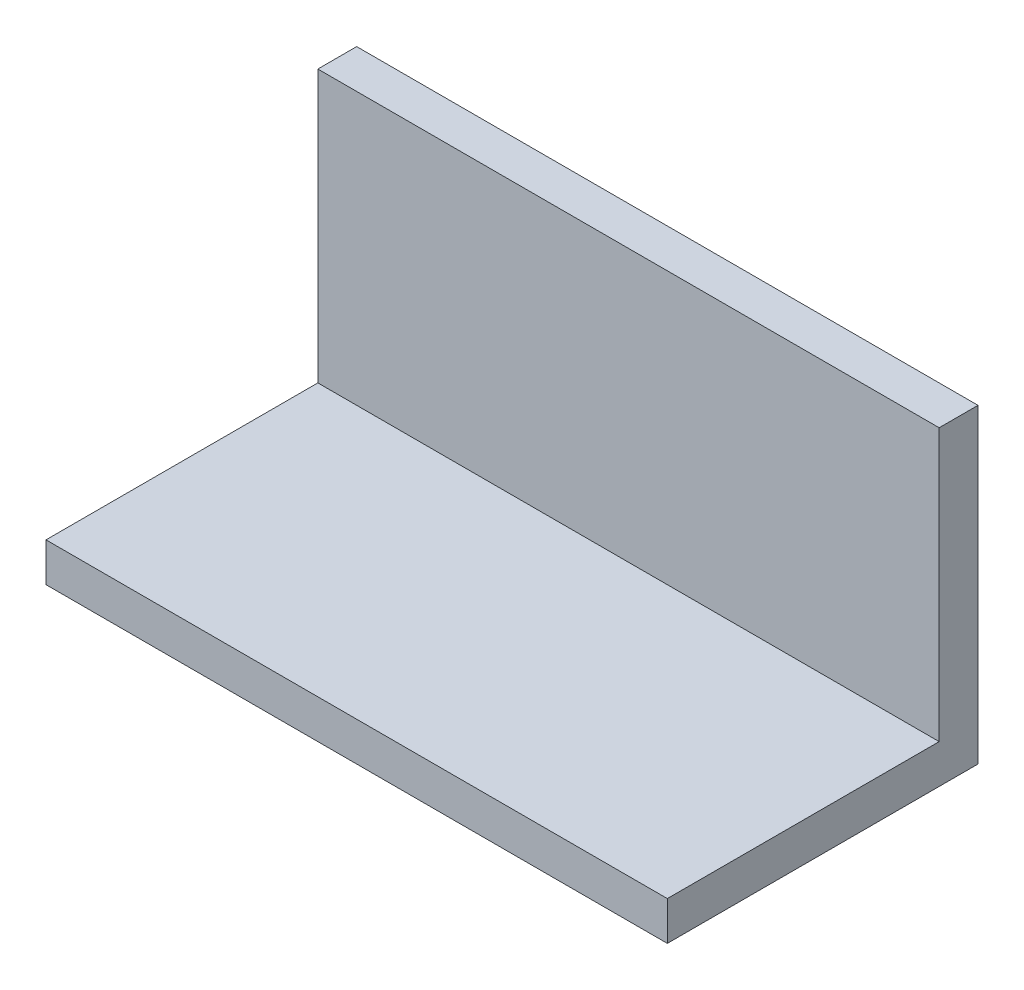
ISO-10303-21;
HEADER;
FILE_DESCRIPTION(('STEP AP214'),'2;1');
FILE_NAME('part.step','',(''),(''),'','','');
FILE_SCHEMA(('AUTOMOTIVE_DESIGN { 1 0 10303 214 1 1 1 1 }'));
ENDSEC;
DATA;
#1=APPLICATION_CONTEXT('core data for automotive mechanical design processes');
#2=APPLICATION_PROTOCOL_DEFINITION('international standard','automotive_design',2000,#1);
#3=PRODUCT_CONTEXT('',#1,'mechanical');
#4=PRODUCT('Part','Part','',(#3));
#5=PRODUCT_RELATED_PRODUCT_CATEGORY('part','',(#4));
#6=PRODUCT_DEFINITION_FORMATION('','',#4);
#7=PRODUCT_DEFINITION_CONTEXT('part definition',#1,'design');
#8=PRODUCT_DEFINITION('design','',#6,#7);
#9=PRODUCT_DEFINITION_SHAPE('','',#8);
#10=(LENGTH_UNIT() NAMED_UNIT(*) SI_UNIT(.MILLI.,.METRE.));
#11=(NAMED_UNIT(*) PLANE_ANGLE_UNIT() SI_UNIT($,.RADIAN.));
#12=(NAMED_UNIT(*) SI_UNIT($,.STERADIAN.) SOLID_ANGLE_UNIT());
#13=UNCERTAINTY_MEASURE_WITH_UNIT(LENGTH_MEASURE(1.E-05),#10,'distance_accuracy_value','');
#14=(GEOMETRIC_REPRESENTATION_CONTEXT(3) GLOBAL_UNCERTAINTY_ASSIGNED_CONTEXT((#13)) GLOBAL_UNIT_ASSIGNED_CONTEXT((#10,
#11,#12)) REPRESENTATION_CONTEXT('',''));
#15=CARTESIAN_POINT('',(0.,0.,0.));
#16=DIRECTION('',(0.,0.,1.));
#17=DIRECTION('',(1.,0.,0.));
#18=AXIS2_PLACEMENT_3D('',#15,#16,#17);
#19=CARTESIAN_POINT('',(25.4,-12.7,-12.7));
#20=DIRECTION('',(0.,0.,1.));
#21=DIRECTION('',(1.,0.,0.));
#22=AXIS2_PLACEMENT_3D('',#19,#20,#21);
#23=PLANE('',#22);
#24=DIRECTION('',(0.,1.,0.));
#25=VECTOR('',#24,1.);
#26=CARTESIAN_POINT('',(-25.4,-12.7,-12.7));
#27=LINE('',#26,#25);
#28=CARTESIAN_POINT('',(-25.4,-12.7,-12.7));
#29=VERTEX_POINT('',#28);
#30=CARTESIAN_POINT('',(-25.4,12.7,-12.7));
#31=VERTEX_POINT('',#30);
#32=EDGE_CURVE('E116',#29,#31,#27,.T.);
#33=ORIENTED_EDGE('',*,*,#32,.T.);
#34=DIRECTION('',(-1.,0.,0.));
#35=VECTOR('',#34,1.);
#36=CARTESIAN_POINT('',(25.4,12.7,-12.7));
#37=LINE('',#36,#35);
#38=CARTESIAN_POINT('',(25.4,12.7,-12.7));
#39=VERTEX_POINT('',#38);
#40=EDGE_CURVE('E11',#39,#31,#37,.T.);
#41=ORIENTED_EDGE('',*,*,#40,.F.);
#42=DIRECTION('',(0.,1.,0.));
#43=VECTOR('',#42,1.);
#44=CARTESIAN_POINT('',(25.4,-12.7,-12.7));
#45=LINE('',#44,#43);
#46=CARTESIAN_POINT('',(25.4,-12.7,-12.7));
#47=VERTEX_POINT('',#46);
#48=EDGE_CURVE('E128',#47,#39,#45,.T.);
#49=ORIENTED_EDGE('',*,*,#48,.F.);
#50=DIRECTION('',(-1.,0.,0.));
#51=VECTOR('',#50,1.);
#52=CARTESIAN_POINT('',(25.4,-12.7,-12.7));
#53=LINE('',#52,#51);
#54=EDGE_CURVE('E112',#47,#29,#53,.T.);
#55=ORIENTED_EDGE('',*,*,#54,.T.);
#56=EDGE_LOOP('',(#33,#41,#49,#55));
#57=FACE_BOUND('',#56,.T.);
#58=ADVANCED_FACE('F33',(#57),#23,.F.);
#59=CARTESIAN_POINT('',(25.4,12.7,-9.525));
#60=DIRECTION('',(0.,-1.,0.));
#61=DIRECTION('',(0.,0.,-1.));
#62=AXIS2_PLACEMENT_3D('',#59,#60,#61);
#63=PLANE('',#62);
#64=DIRECTION('',(0.,0.,1.));
#65=VECTOR('',#64,1.);
#66=CARTESIAN_POINT('',(-25.4,12.7,-9.525));
#67=LINE('',#66,#65);
#68=CARTESIAN_POINT('',(-25.4,12.7,-9.525));
#69=VERTEX_POINT('',#68);
#70=EDGE_CURVE('E119',#31,#69,#67,.T.);
#71=ORIENTED_EDGE('',*,*,#70,.T.);
#72=DIRECTION('',(-1.,0.,0.));
#73=VECTOR('',#72,1.);
#74=CARTESIAN_POINT('',(25.4,12.7,-9.525));
#75=LINE('',#74,#73);
#76=CARTESIAN_POINT('',(25.4,12.7,-9.525));
#77=VERTEX_POINT('',#76);
#78=EDGE_CURVE('E41',#77,#69,#75,.T.);
#79=ORIENTED_EDGE('',*,*,#78,.F.);
#80=DIRECTION('',(0.,0.,1.));
#81=VECTOR('',#80,1.);
#82=CARTESIAN_POINT('',(25.4,12.7,-9.525));
#83=LINE('',#82,#81);
#84=EDGE_CURVE('E86',#39,#77,#83,.T.);
#85=ORIENTED_EDGE('',*,*,#84,.F.);
#86=ORIENTED_EDGE('',*,*,#40,.T.);
#87=EDGE_LOOP('',(#71,#79,#85,#86));
#88=FACE_BOUND('',#87,.T.);
#89=ADVANCED_FACE('F134',(#88),#63,.F.);
#90=CARTESIAN_POINT('',(25.4,-9.525,-9.525));
#91=DIRECTION('',(0.,0.,-1.));
#92=DIRECTION('',(-1.,0.,0.));
#93=AXIS2_PLACEMENT_3D('',#90,#91,#92);
#94=PLANE('',#93);
#95=DIRECTION('',(0.,-1.,0.));
#96=VECTOR('',#95,1.);
#97=CARTESIAN_POINT('',(-25.4,-9.525,-9.525));
#98=LINE('',#97,#96);
#99=CARTESIAN_POINT('',(-25.4,-9.525,-9.525));
#100=VERTEX_POINT('',#99);
#101=EDGE_CURVE('E122',#69,#100,#98,.T.);
#102=ORIENTED_EDGE('',*,*,#101,.T.);
#103=DIRECTION('',(-1.,0.,0.));
#104=VECTOR('',#103,1.);
#105=CARTESIAN_POINT('',(25.4,-9.525,-9.525));
#106=LINE('',#105,#104);
#107=CARTESIAN_POINT('',(25.4,-9.525,-9.525));
#108=VERTEX_POINT('',#107);
#109=EDGE_CURVE('E107',#108,#100,#106,.T.);
#110=ORIENTED_EDGE('',*,*,#109,.F.);
#111=DIRECTION('',(0.,-1.,0.));
#112=VECTOR('',#111,1.);
#113=CARTESIAN_POINT('',(25.4,9.525,-9.525));
#114=LINE('',#113,#112);
#115=EDGE_CURVE('E99',#77,#108,#114,.T.);
#116=ORIENTED_EDGE('',*,*,#115,.F.);
#117=ORIENTED_EDGE('',*,*,#78,.T.);
#118=EDGE_LOOP('',(#102,#110,#116,#117));
#119=FACE_BOUND('',#118,.T.);
#120=ADVANCED_FACE('F133',(#119),#94,.F.);
#121=CARTESIAN_POINT('',(25.4,-9.525,9.525));
#122=DIRECTION('',(0.,-1.,0.));
#123=DIRECTION('',(0.,0.,-1.));
#124=AXIS2_PLACEMENT_3D('',#121,#122,#123);
#125=PLANE('',#124);
#126=DIRECTION('',(0.,0.,1.));
#127=VECTOR('',#126,1.);
#128=CARTESIAN_POINT('',(-25.4,-9.525,9.525));
#129=LINE('',#128,#127);
#130=CARTESIAN_POINT('',(-25.4,-9.525,12.7));
#131=VERTEX_POINT('',#130);
#132=EDGE_CURVE('E106',#100,#131,#129,.T.);
#133=ORIENTED_EDGE('',*,*,#132,.T.);
#134=DIRECTION('',(-1.,0.,0.));
#135=VECTOR('',#134,1.);
#136=CARTESIAN_POINT('',(25.4,-9.525,12.7));
#137=LINE('',#136,#135);
#138=CARTESIAN_POINT('',(25.4,-9.525,12.7));
#139=VERTEX_POINT('',#138);
#140=EDGE_CURVE('E104',#139,#131,#137,.T.);
#141=ORIENTED_EDGE('',*,*,#140,.F.);
#142=DIRECTION('',(0.,0.,1.));
#143=VECTOR('',#142,1.);
#144=CARTESIAN_POINT('',(25.4,-9.525,9.525));
#145=LINE('',#144,#143);
#146=EDGE_CURVE('E93',#108,#139,#145,.T.);
#147=ORIENTED_EDGE('',*,*,#146,.F.);
#148=ORIENTED_EDGE('',*,*,#109,.T.);
#149=EDGE_LOOP('',(#133,#141,#147,#148));
#150=FACE_BOUND('',#149,.T.);
#151=ADVANCED_FACE('F105',(#150),#125,.F.);
#152=CARTESIAN_POINT('',(25.4,-12.7,12.7));
#153=DIRECTION('',(0.,0.,-1.));
#154=DIRECTION('',(-1.,0.,0.));
#155=AXIS2_PLACEMENT_3D('',#152,#153,#154);
#156=PLANE('',#155);
#157=DIRECTION('',(0.,-1.,0.));
#158=VECTOR('',#157,1.);
#159=CARTESIAN_POINT('',(-25.4,-12.7,12.7));
#160=LINE('',#159,#158);
#161=CARTESIAN_POINT('',(-25.4,-12.7,12.7));
#162=VERTEX_POINT('',#161);
#163=EDGE_CURVE('E72',#131,#162,#160,.T.);
#164=ORIENTED_EDGE('',*,*,#163,.T.);
#165=DIRECTION('',(-1.,0.,0.));
#166=VECTOR('',#165,1.);
#167=CARTESIAN_POINT('',(25.4,-12.7,12.7));
#168=LINE('',#167,#166);
#169=CARTESIAN_POINT('',(25.4,-12.7,12.7));
#170=VERTEX_POINT('',#169);
#171=EDGE_CURVE('E108',#170,#162,#168,.T.);
#172=ORIENTED_EDGE('',*,*,#171,.F.);
#173=DIRECTION('',(0.,-1.,0.));
#174=VECTOR('',#173,1.);
#175=CARTESIAN_POINT('',(25.4,-12.7,12.7));
#176=LINE('',#175,#174);
#177=EDGE_CURVE('E97',#139,#170,#176,.T.);
#178=ORIENTED_EDGE('',*,*,#177,.F.);
#179=ORIENTED_EDGE('',*,*,#140,.T.);
#180=EDGE_LOOP('',(#164,#172,#178,#179));
#181=FACE_BOUND('',#180,.T.);
#182=ADVANCED_FACE('F110',(#181),#156,.F.);
#183=CARTESIAN_POINT('',(25.4,-12.7,12.7));
#184=DIRECTION('',(0.,1.,0.));
#185=DIRECTION('',(0.,0.,1.));
#186=AXIS2_PLACEMENT_3D('',#183,#184,#185);
#187=PLANE('',#186);
#188=DIRECTION('',(0.,0.,-1.));
#189=VECTOR('',#188,1.);
#190=CARTESIAN_POINT('',(-25.4,-12.7,12.7));
#191=LINE('',#190,#189);
#192=EDGE_CURVE('E78',#162,#29,#191,.T.);
#193=ORIENTED_EDGE('',*,*,#192,.T.);
#194=ORIENTED_EDGE('',*,*,#54,.F.);
#195=DIRECTION('',(0.,0.,-1.));
#196=VECTOR('',#195,1.);
#197=CARTESIAN_POINT('',(25.4,-12.7,12.7));
#198=LINE('',#197,#196);
#199=EDGE_CURVE('E49',#170,#47,#198,.T.);
#200=ORIENTED_EDGE('',*,*,#199,.F.);
#201=ORIENTED_EDGE('',*,*,#171,.T.);
#202=EDGE_LOOP('',(#193,#194,#200,#201));
#203=FACE_BOUND('',#202,.T.);
#204=ADVANCED_FACE('F141',(#203),#187,.F.);
#205=CARTESIAN_POINT('',(25.4,0.,0.));
#206=DIRECTION('',(-1.,0.,0.));
#207=DIRECTION('',(0.,0.,1.));
#208=AXIS2_PLACEMENT_3D('',#205,#206,#207);
#209=PLANE('',#208);
#210=ORIENTED_EDGE('',*,*,#48,.T.);
#211=ORIENTED_EDGE('',*,*,#84,.T.);
#212=ORIENTED_EDGE('',*,*,#115,.T.);
#213=ORIENTED_EDGE('',*,*,#146,.T.);
#214=ORIENTED_EDGE('',*,*,#177,.T.);
#215=ORIENTED_EDGE('',*,*,#199,.T.);
#216=EDGE_LOOP('',(#210,#211,#212,#213,#214,#215));
#217=FACE_BOUND('',#216,.T.);
#218=ADVANCED_FACE('F95',(#217),#209,.F.);
#219=CARTESIAN_POINT('',(-25.4,0.,0.));
#220=DIRECTION('',(-1.,0.,0.));
#221=DIRECTION('',(0.,0.,1.));
#222=AXIS2_PLACEMENT_3D('',#219,#220,#221);
#223=PLANE('',#222);
#224=ORIENTED_EDGE('',*,*,#32,.F.);
#225=ORIENTED_EDGE('',*,*,#192,.F.);
#226=ORIENTED_EDGE('',*,*,#163,.F.);
#227=ORIENTED_EDGE('',*,*,#132,.F.);
#228=ORIENTED_EDGE('',*,*,#101,.F.);
#229=ORIENTED_EDGE('',*,*,#70,.F.);
#230=EDGE_LOOP('',(#224,#225,#226,#227,#228,#229));
#231=FACE_BOUND('',#230,.T.);
#232=ADVANCED_FACE('F138',(#231),#223,.T.);
#233=CLOSED_SHELL('',(#58,#89,#120,#151,#182,#204,#218,#232));
#234=MANIFOLD_SOLID_BREP('B2',#233);
#235=ADVANCED_BREP_SHAPE_REPRESENTATION('',(#18,#234),#14);
#236=SHAPE_DEFINITION_REPRESENTATION(#9,#235);
ENDSEC;
END-ISO-10303-21;
